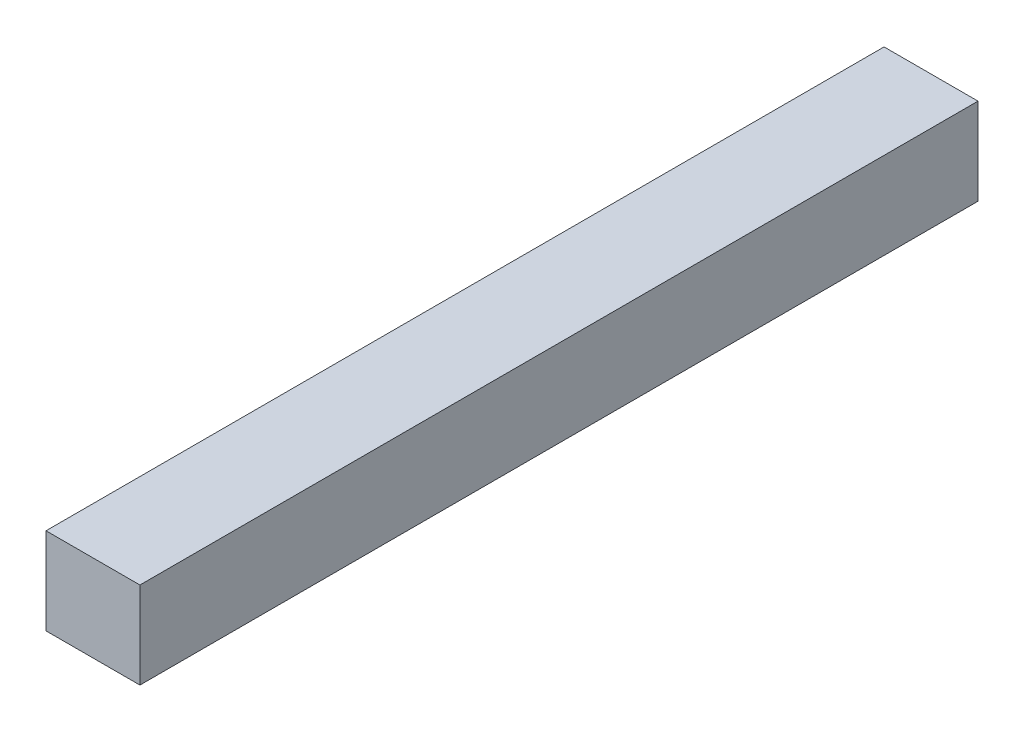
from build123d import *

# Parameters (mm, degrees)
ESQUISSE1_W        = 65
ESQUISSE1_H        = 60
BOSS_EXTRU_1_DEPTH = 580


with BuildPart() as part:
    # Esquisse1 → Boss.-Extru.1 (new body)
    with BuildSketch(Plane.XY):
        Rectangle(ESQUISSE1_W, ESQUISSE1_H)
    extrude(amount=BOSS_EXTRU_1_DEPTH)


solid = part.part
